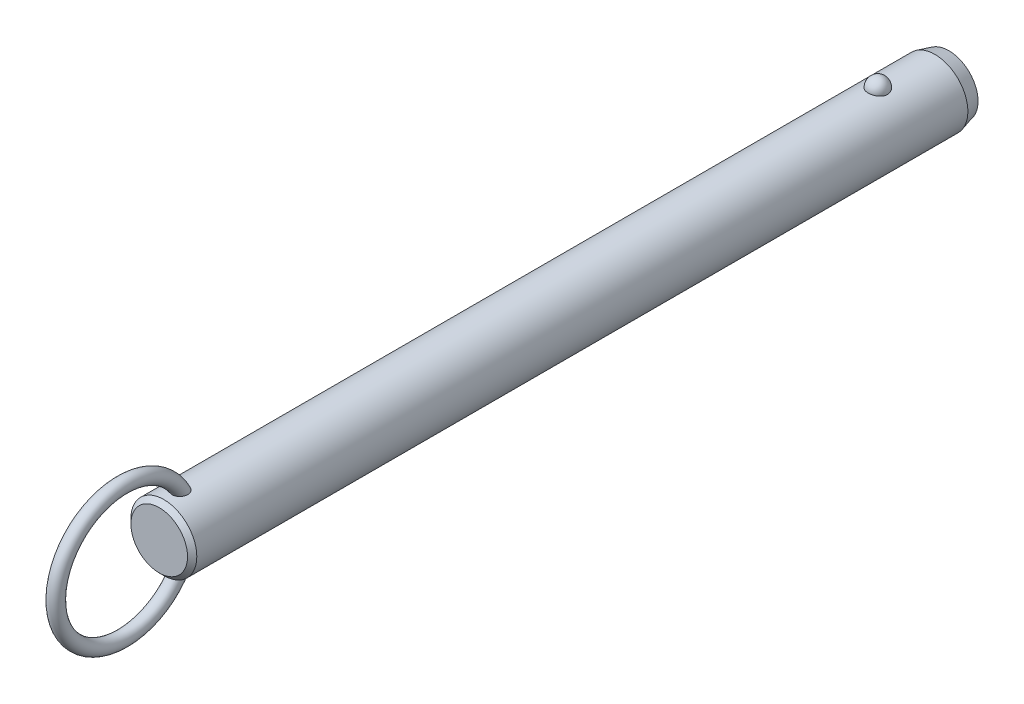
ISO-10303-21;
HEADER;
FILE_DESCRIPTION(('STEP AP214'),'2;1');
FILE_NAME('part.step','',(''),(''),'','','');
FILE_SCHEMA(('AUTOMOTIVE_DESIGN { 1 0 10303 214 1 1 1 1 }'));
ENDSEC;
DATA;
#1=APPLICATION_CONTEXT('core data for automotive mechanical design processes');
#2=APPLICATION_PROTOCOL_DEFINITION('international standard','automotive_design',2000,#1);
#3=PRODUCT_CONTEXT('',#1,'mechanical');
#4=PRODUCT('Part','Part','',(#3));
#5=PRODUCT_RELATED_PRODUCT_CATEGORY('part','',(#4));
#6=PRODUCT_DEFINITION_FORMATION('','',#4);
#7=PRODUCT_DEFINITION_CONTEXT('part definition',#1,'design');
#8=PRODUCT_DEFINITION('design','',#6,#7);
#9=PRODUCT_DEFINITION_SHAPE('','',#8);
#10=(LENGTH_UNIT() NAMED_UNIT(*) SI_UNIT(.MILLI.,.METRE.));
#11=(NAMED_UNIT(*) PLANE_ANGLE_UNIT() SI_UNIT($,.RADIAN.));
#12=(NAMED_UNIT(*) SI_UNIT($,.STERADIAN.) SOLID_ANGLE_UNIT());
#13=UNCERTAINTY_MEASURE_WITH_UNIT(LENGTH_MEASURE(1.E-05),#10,'distance_accuracy_value','');
#14=(GEOMETRIC_REPRESENTATION_CONTEXT(3) GLOBAL_UNCERTAINTY_ASSIGNED_CONTEXT((#13)) GLOBAL_UNIT_ASSIGNED_CONTEXT((#10,
#11,#12)) REPRESENTATION_CONTEXT('',''));
#15=CARTESIAN_POINT('',(0.,0.,0.));
#16=DIRECTION('',(0.,0.,1.));
#17=DIRECTION('',(1.,0.,0.));
#18=AXIS2_PLACEMENT_3D('',#15,#16,#17);
#19=CARTESIAN_POINT('',(0.,0.,144.8));
#20=DIRECTION('',(0.,0.,-1.));
#21=DIRECTION('',(-1.,0.,0.));
#22=AXIS2_PLACEMENT_3D('',#19,#20,#21);
#23=CYLINDRICAL_SURFACE('',#22,7.1);
#24=CARTESIAN_POINT('',(2.0769088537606,6.78943661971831,-2.10000000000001));
#25=CARTESIAN_POINT('',(2.07690739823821,6.78943796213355,-1.98268154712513));
#26=CARTESIAN_POINT('',(2.06738130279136,6.79237331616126,-1.86534506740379));
#27=CARTESIAN_POINT('',(2.0295040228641,6.8037853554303,-1.63400788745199));
#28=CARTESIAN_POINT('',(2.00114757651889,6.81226358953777,-1.52000812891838));
#29=CARTESIAN_POINT('',(1.92632025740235,6.83379798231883,-1.29863433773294));
#30=CARTESIAN_POINT('',(1.87985726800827,6.84685214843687,-1.19125744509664));
#31=CARTESIAN_POINT('',(1.76995205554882,6.87608091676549,-0.986046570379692));
#32=CARTESIAN_POINT('',(1.70650980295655,6.8922555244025,-0.888212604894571));
#33=CARTESIAN_POINT('',(1.56381192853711,6.92602930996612,-0.704242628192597));
#34=CARTESIAN_POINT('',(1.4844714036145,6.94363582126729,-0.618173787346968));
#35=CARTESIAN_POINT('',(1.31221746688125,6.97823658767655,-0.460740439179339));
#36=CARTESIAN_POINT('',(1.21930409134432,6.99523084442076,-0.389375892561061));
#37=CARTESIAN_POINT('',(1.02268781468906,7.02666176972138,-0.263547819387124));
#38=CARTESIAN_POINT('',(0.919020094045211,7.04110638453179,-0.209031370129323));
#39=CARTESIAN_POINT('',(0.703548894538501,7.06588726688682,-0.118163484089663));
#40=CARTESIAN_POINT('',(0.591746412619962,7.07622403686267,-0.0818098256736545));
#41=CARTESIAN_POINT('',(0.365557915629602,7.09147068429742,-0.0288711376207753));
#42=CARTESIAN_POINT('',(0.251267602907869,7.09648447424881,-0.011907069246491));
#43=CARTESIAN_POINT('',(0.0213499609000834,7.10089837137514,0.00304925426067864));
#44=CARTESIAN_POINT('',(-0.0942772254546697,7.10029907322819,0.00104351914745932));
#45=CARTESIAN_POINT('',(-0.3216515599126,7.09360829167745,-0.0216931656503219));
#46=CARTESIAN_POINT('',(-0.433431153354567,7.08760388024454,-0.0421272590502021));
#47=CARTESIAN_POINT('',(-0.651862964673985,7.07086131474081,-0.100729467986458));
#48=CARTESIAN_POINT('',(-0.758515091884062,7.06012307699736,-0.13889789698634));
#49=CARTESIAN_POINT('',(-0.964449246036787,7.03496097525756,-0.232213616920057));
#50=CARTESIAN_POINT('',(-1.06368095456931,7.02051445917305,-0.287465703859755));
#51=CARTESIAN_POINT('',(-1.25145353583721,6.98948740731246,-0.413383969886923));
#52=CARTESIAN_POINT('',(-1.33999321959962,6.97290663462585,-0.484051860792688));
#53=CARTESIAN_POINT('',(-1.50591604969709,6.93898770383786,-0.640594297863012));
#54=CARTESIAN_POINT('',(-1.58302488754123,6.92164094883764,-0.726757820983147));
#55=CARTESIAN_POINT('',(-1.72189320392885,6.8884103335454,-0.910927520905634));
#56=CARTESIAN_POINT('',(-1.78365144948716,6.87252659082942,-1.00893464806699));
#57=CARTESIAN_POINT('',(-1.89101272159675,6.84377189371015,-1.21549497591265));
#58=CARTESIAN_POINT('',(-1.93639553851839,6.83094274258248,-1.32416860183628));
#59=CARTESIAN_POINT('',(-2.00874275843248,6.81002070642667,-1.54791500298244));
#60=CARTESIAN_POINT('',(-2.03570774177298,6.80192767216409,-1.66298757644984));
#61=CARTESIAN_POINT('',(-2.07047276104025,6.7914266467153,-1.89571453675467));
#62=CARTESIAN_POINT('',(-2.07835878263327,6.78899315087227,-2.01335491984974));
#63=CARTESIAN_POINT('',(-2.07502083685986,6.79001409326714,-2.24833570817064));
#64=CARTESIAN_POINT('',(-2.06379746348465,6.7934683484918,-2.36567612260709));
#65=CARTESIAN_POINT('',(-2.02263913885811,6.80583442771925,-2.59603194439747));
#66=CARTESIAN_POINT('',(-1.99281127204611,6.81471501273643,-2.70906820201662));
#67=CARTESIAN_POINT('',(-1.91526639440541,6.83691232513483,-2.92836575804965));
#68=CARTESIAN_POINT('',(-1.8675486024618,6.85022924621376,-3.03462676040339));
#69=CARTESIAN_POINT('',(-1.75504492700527,6.87991336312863,-3.23806487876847));
#70=CARTESIAN_POINT('',(-1.69015924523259,6.89629822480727,-3.33518422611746));
#71=CARTESIAN_POINT('',(-1.54505404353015,6.93024852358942,-3.51697105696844));
#72=CARTESIAN_POINT('',(-1.46483385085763,6.94781401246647,-3.60163799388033));
#73=CARTESIAN_POINT('',(-1.29071406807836,6.98225977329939,-3.75654119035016));
#74=CARTESIAN_POINT('',(-1.19675650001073,6.99913673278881,-3.82671308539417));
#75=CARTESIAN_POINT('',(-0.997940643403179,7.03023618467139,-3.9501837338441));
#76=CARTESIAN_POINT('',(-0.893083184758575,7.04445887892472,-4.00348377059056));
#77=CARTESIAN_POINT('',(-0.676902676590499,7.06848365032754,-4.09107242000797));
#78=CARTESIAN_POINT('',(-0.565686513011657,7.0783430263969,-4.12560889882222));
#79=CARTESIAN_POINT('',(-0.338739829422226,7.09282534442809,-4.17575450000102));
#80=CARTESIAN_POINT('',(-0.2230099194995,7.09744899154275,-4.19136617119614));
#81=CARTESIAN_POINT('',(0.00707628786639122,7.10090930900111,-4.20307965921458));
#82=CARTESIAN_POINT('',(0.121410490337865,7.09986531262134,-4.19958377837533));
#83=CARTESIAN_POINT('',(0.34781544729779,7.092380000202,-4.17411564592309));
#84=CARTESIAN_POINT('',(0.459886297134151,7.08593891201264,-4.15214417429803));
#85=CARTESIAN_POINT('',(0.67808462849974,7.06838983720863,-4.09049562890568));
#86=CARTESIAN_POINT('',(0.784237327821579,7.05730369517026,-4.05090137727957));
#87=CARTESIAN_POINT('',(0.988305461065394,7.03163139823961,-3.95511447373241));
#88=CARTESIAN_POINT('',(1.08622031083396,7.01704499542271,-3.89892064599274));
#89=CARTESIAN_POINT('',(1.27284490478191,6.98562668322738,-3.77035541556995));
#90=CARTESIAN_POINT('',(1.36137372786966,6.96876135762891,-3.69772964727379));
#91=CARTESIAN_POINT('',(1.52509486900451,6.93477412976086,-3.53878279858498));
#92=CARTESIAN_POINT('',(1.60028496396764,6.91765218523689,-3.45245943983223));
#93=CARTESIAN_POINT('',(1.73681688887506,6.88465753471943,-3.26658774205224));
#94=CARTESIAN_POINT('',(1.79785966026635,6.86881574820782,-3.16681408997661));
#95=CARTESIAN_POINT('',(1.90265327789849,6.84053157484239,-2.95814408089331));
#96=CARTESIAN_POINT('',(1.94640861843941,6.82808830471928,-2.84925010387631));
#97=CARTESIAN_POINT('',(2.01274378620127,6.80881460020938,-2.63454318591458));
#98=CARTESIAN_POINT('',(2.03676193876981,6.80160856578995,-2.52920574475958));
#99=CARTESIAN_POINT('',(2.06884490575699,6.79191902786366,-2.3159172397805));
#100=CARTESIAN_POINT('',(2.07691019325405,6.78943538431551,-2.20796625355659));
#101=CARTESIAN_POINT('',(2.0769088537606,6.78943661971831,-2.10000000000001));
#102=B_SPLINE_CURVE_WITH_KNOTS('',3,(#24,#25,#26,#27,#28,#29,#30,#31,#32,#33,#34,#35,#36,#37,
#38,#39,#40,#41,#42,#43,#44,#45,#46,#47,#48,#49,#50,#51,#52,#53,#54,#55,#56,#57,#58,#59,#60,#61,
#62,#63,#64,#65,#66,#67,#68,#69,#70,#71,#72,#73,#74,#75,#76,#77,#78,#79,#80,#81,#82,#83,#84,#85,
#86,#87,#88,#89,#90,#91,#92,#93,#94,#95,#96,#97,#98,#99,#100,#101),.UNSPECIFIED.,.T.,.F.,(4,2,2,
2,2,2,2,2,2,2,2,2,2,2,2,2,2,2,2,2,2,2,2,2,2,2,2,2,2,2,2,2,2,2,2,2,2,2,4),(0.,0.351568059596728,
0.703234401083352,1.05474780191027,1.40626181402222,1.75970563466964,2.11314851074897,
2.46546960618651,2.81774759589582,3.16301449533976,3.50824481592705,3.84801136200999,
4.18778391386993,4.52968352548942,4.87162112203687,5.22076181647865,5.56993054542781,
5.92363364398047,6.27732559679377,6.62942052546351,6.98150450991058,7.33158042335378,
7.68167162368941,8.03384443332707,8.38603269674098,8.73975272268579,9.09344583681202,
9.44234545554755,9.79119807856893,10.1327344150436,10.4742563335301,10.8141898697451,
11.1541474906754,11.4997793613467,11.8454687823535,12.1979079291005,12.5502553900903,
12.8738073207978,13.1973496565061),.UNSPECIFIED.);
#103=CARTESIAN_POINT('',(2.0769088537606,6.78943661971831,-2.10000000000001));
#104=VERTEX_POINT('',#103);
#105=EDGE_CURVE('E41',#104,#104,#102,.T.);
#106=ORIENTED_EDGE('',*,*,#105,.T.);
#107=EDGE_LOOP('',(#106));
#108=FACE_BOUND('',#107,.T.);
#109=CARTESIAN_POINT('',(0.,0.,151.72));
#110=DIRECTION('',(0.,0.,1.));
#111=DIRECTION('',(1.,0.,0.));
#112=AXIS2_PLACEMENT_3D('',#109,#110,#111);
#113=CIRCLE('',#112,7.1);
#114=CARTESIAN_POINT('',(7.1,0.,151.72));
#115=VERTEX_POINT('',#114);
#116=EDGE_CURVE('E10',#115,#115,#113,.F.);
#117=ORIENTED_EDGE('',*,*,#116,.T.);
#118=EDGE_LOOP('',(#117));
#119=FACE_BOUND('',#118,.T.);
#120=CARTESIAN_POINT('',(-0.429539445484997,-7.08699541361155,146.542921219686));
#121=CARTESIAN_POINT('',(-0.508331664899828,-7.08221999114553,146.566876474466));
#122=CARTESIAN_POINT('',(-0.585039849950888,-7.07624016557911,146.597457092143));
#123=CARTESIAN_POINT('',(-0.73208265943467,-7.06254296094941,146.671024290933));
#124=CARTESIAN_POINT('',(-0.802417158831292,-7.05482554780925,146.714011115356));
#125=CARTESIAN_POINT('',(-0.934722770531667,-7.03851844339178,146.811113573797));
#126=CARTESIAN_POINT('',(-0.996700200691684,-7.02992941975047,146.865220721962));
#127=CARTESIAN_POINT('',(-1.11079942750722,-7.01280697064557,146.982967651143));
#128=CARTESIAN_POINT('',(-1.16292136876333,-7.00427354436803,147.046607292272));
#129=CARTESIAN_POINT('',(-1.25705660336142,-6.98799959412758,147.182687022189));
#130=CARTESIAN_POINT('',(-1.29888032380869,-6.98027525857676,147.255259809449));
#131=CARTESIAN_POINT('',(-1.37069920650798,-6.96652886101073,147.406168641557));
#132=CARTESIAN_POINT('',(-1.40069157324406,-6.96050720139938,147.484506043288));
#133=CARTESIAN_POINT('',(-1.45043507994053,-6.95031881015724,147.650190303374));
#134=CARTESIAN_POINT('',(-1.46937115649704,-6.94630231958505,147.737789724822));
#135=CARTESIAN_POINT('',(-1.49424917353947,-6.94099239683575,147.914871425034));
#136=CARTESIAN_POINT('',(-1.50018601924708,-6.93970003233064,148.004354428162));
#137=CARTESIAN_POINT('',(-1.49978214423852,-6.93978815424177,148.194060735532));
#138=CARTESIAN_POINT('',(-1.49187639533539,-6.94150934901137,148.294279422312));
#139=CARTESIAN_POINT('',(-1.46177925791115,-6.94790814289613,148.492479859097));
#140=CARTESIAN_POINT('',(-1.43957541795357,-6.95258831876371,148.590459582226));
#141=CARTESIAN_POINT('',(-1.37783293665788,-6.96510647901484,148.79536292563));
#142=CARTESIAN_POINT('',(-1.33634073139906,-6.97328848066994,148.901680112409));
#143=CARTESIAN_POINT('',(-1.23686994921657,-6.99161706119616,149.106177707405));
#144=CARTESIAN_POINT('',(-1.17889192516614,-7.00176357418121,149.204358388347));
#145=CARTESIAN_POINT('',(-1.05875124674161,-7.02082898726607,149.372374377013));
#146=CARTESIAN_POINT('',(-0.999247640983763,-7.02963746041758,149.444123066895));
#147=CARTESIAN_POINT('',(-0.869494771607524,-7.04686074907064,149.577195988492));
#148=CARTESIAN_POINT('',(-0.799263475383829,-7.05527619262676,149.638537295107));
#149=CARTESIAN_POINT('',(-0.665408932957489,-7.06899457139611,149.735131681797));
#150=CARTESIAN_POINT('',(-0.603817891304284,-7.07457275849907,149.773151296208));
#151=CARTESIAN_POINT('',(-0.475172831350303,-7.08437420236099,149.838758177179));
#152=CARTESIAN_POINT('',(-0.408123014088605,-7.08859848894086,149.866353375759));
#153=CARTESIAN_POINT('',(-0.26943193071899,-7.09522749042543,149.909256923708));
#154=CARTESIAN_POINT('',(-0.19775731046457,-7.09761688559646,149.924461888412));
#155=CARTESIAN_POINT('',(-0.0527849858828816,-7.10017268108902,149.940716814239));
#156=CARTESIAN_POINT('',(0.0205115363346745,-7.10034065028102,149.941776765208));
#157=CARTESIAN_POINT('',(0.156426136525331,-7.09855986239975,149.930461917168));
#158=CARTESIAN_POINT('',(0.219199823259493,-7.09688191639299,149.919806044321));
#159=CARTESIAN_POINT('',(0.342134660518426,-7.09201880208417,149.888537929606));
#160=CARTESIAN_POINT('',(0.40229529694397,-7.08883333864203,149.867923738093));
#161=CARTESIAN_POINT('',(0.520687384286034,-7.08113868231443,149.817212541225));
#162=CARTESIAN_POINT('',(0.578791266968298,-7.07658958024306,149.786827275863));
#163=CARTESIAN_POINT('',(0.69017323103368,-7.06659708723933,149.718367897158));
#164=CARTESIAN_POINT('',(0.743447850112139,-7.061153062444,149.680288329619));
#165=CARTESIAN_POINT('',(0.870947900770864,-7.04680292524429,149.576592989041));
#166=CARTESIAN_POINT('',(0.941828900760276,-7.03755800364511,149.506897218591));
#167=CARTESIAN_POINT('',(1.07136606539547,-7.01900793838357,149.356945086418));
#168=CARTESIAN_POINT('',(1.13000013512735,-7.00970271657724,149.276670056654));
#169=CARTESIAN_POINT('',(1.23579584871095,-6.99183327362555,149.106899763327));
#170=CARTESIAN_POINT('',(1.28274271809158,-6.98328455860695,149.017269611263));
#171=CARTESIAN_POINT('',(1.3635144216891,-6.96796352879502,148.832176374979));
#172=CARTESIAN_POINT('',(1.39733971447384,-6.96119115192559,148.736713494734));
#173=CARTESIAN_POINT('',(1.45579181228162,-6.94922464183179,148.52530928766));
#174=CARTESIAN_POINT('',(1.47790145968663,-6.94449000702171,148.408631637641));
#175=CARTESIAN_POINT('',(1.50168752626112,-6.93938731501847,148.173015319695));
#176=CARTESIAN_POINT('',(1.50336085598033,-6.93901991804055,148.05407631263));
#177=CARTESIAN_POINT('',(1.48486516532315,-6.9430010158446,147.82360799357));
#178=CARTESIAN_POINT('',(1.46573441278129,-6.9471253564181,147.711995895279));
#179=CARTESIAN_POINT('',(1.40606892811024,-6.95944667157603,147.494886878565));
#180=CARTESIAN_POINT('',(1.36556446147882,-6.96763788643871,147.3893815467));
#181=CARTESIAN_POINT('',(1.2708270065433,-6.98548038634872,147.204287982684));
#182=CARTESIAN_POINT('',(1.21949810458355,-6.99473841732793,147.123171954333));
#183=CARTESIAN_POINT('',(1.10242050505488,-7.01414069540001,146.972227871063));
#184=CARTESIAN_POINT('',(1.03668119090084,-7.02428436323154,146.90239252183));
#185=CARTESIAN_POINT('',(0.900559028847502,-7.04295285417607,146.783573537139));
#186=CARTESIAN_POINT('',(0.831428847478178,-7.05153466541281,146.733157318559));
#187=CARTESIAN_POINT('',(0.685291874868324,-7.06723150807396,146.645142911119));
#188=CARTESIAN_POINT('',(0.608287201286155,-7.07434693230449,146.607541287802));
#189=CARTESIAN_POINT('',(0.451878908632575,-7.08602232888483,146.547491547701));
#190=CARTESIAN_POINT('',(0.372686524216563,-7.09067127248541,146.524508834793));
#191=CARTESIAN_POINT('',(0.211477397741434,-7.09730788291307,146.492035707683));
#192=CARTESIAN_POINT('',(0.129460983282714,-7.09929585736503,146.48254373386));
#193=CARTESIAN_POINT('',(-0.0332905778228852,-7.10037858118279,146.477351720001));
#194=CARTESIAN_POINT('',(-0.114016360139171,-7.09953334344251,146.481365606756));
#195=CARTESIAN_POINT('',(-0.273670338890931,-7.09517338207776,146.502454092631));
#196=CARTESIAN_POINT('',(-0.352598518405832,-7.09165863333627,146.519528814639));
#197=CARTESIAN_POINT('',(-0.429539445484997,-7.08699541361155,146.542921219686));
#198=B_SPLINE_CURVE_WITH_KNOTS('',3,(#120,#121,#122,#123,#124,#125,#126,#127,#128,#129,#130,
#131,#132,#133,#134,#135,#136,#137,#138,#139,#140,#141,#142,#143,#144,#145,#146,#147,#148,#149,
#150,#151,#152,#153,#154,#155,#156,#157,#158,#159,#160,#161,#162,#163,#164,#165,#166,#167,#168,
#169,#170,#171,#172,#173,#174,#175,#176,#177,#178,#179,#180,#181,#182,#183,#184,#185,#186,#187,
#188,#189,#190,#191,#192,#193,#194,#195,#196,#197),.UNSPECIFIED.,.T.,.F.,(4,2,2,2,2,2,2,2,2,2,2,
2,2,2,2,2,2,2,2,2,2,2,2,2,2,2,2,2,2,2,2,2,2,2,2,2,2,2,4),(0.,0.247183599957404,
0.494372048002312,0.741372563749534,0.988369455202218,1.23962059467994,1.490931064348,
1.75897818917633,2.02713035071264,2.3275826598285,2.62829697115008,2.97008736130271,
3.31186629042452,3.59175319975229,3.87117637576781,4.08813841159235,4.30493502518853,
4.5235225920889,4.74195577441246,4.93215328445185,5.12238804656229,5.31884850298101,
5.51544871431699,5.81332317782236,6.11173048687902,6.41527266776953,6.71880423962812,
7.07358156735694,7.42841252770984,7.76631485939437,8.10373999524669,8.39142246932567,
8.67891817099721,8.93560332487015,9.19221962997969,9.43881106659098,9.68537399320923,
9.92674752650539,10.1681233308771),.UNSPECIFIED.);
#199=CARTESIAN_POINT('',(-0.429539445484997,-7.08699541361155,146.542921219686));
#200=VERTEX_POINT('',#199);
#201=EDGE_CURVE('E60',#200,#200,#198,.T.);
#202=ORIENTED_EDGE('',*,*,#201,.T.);
#203=EDGE_LOOP('',(#202));
#204=FACE_BOUND('',#203,.T.);
#205=CARTESIAN_POINT('',(-0.429539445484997,7.08699541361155,146.542921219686));
#206=CARTESIAN_POINT('',(-0.351665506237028,7.09171429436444,146.519246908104));
#207=CARTESIAN_POINT('',(-0.271733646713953,7.09525896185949,146.502036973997));
#208=CARTESIAN_POINT('',(-0.110026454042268,7.09960839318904,146.481005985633));
#209=CARTESIAN_POINT('',(-0.0282502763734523,7.10041187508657,146.477191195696));
#210=CARTESIAN_POINT('',(0.134782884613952,7.09918849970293,146.483059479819));
#211=CARTESIAN_POINT('',(0.216039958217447,7.09716214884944,146.49274013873));
#212=CARTESIAN_POINT('',(0.375730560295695,7.09050177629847,146.525347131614));
#213=CARTESIAN_POINT('',(0.454164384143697,7.08586802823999,146.548272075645));
#214=CARTESIAN_POINT('',(0.606025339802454,7.07449911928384,146.606771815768));
#215=CARTESIAN_POINT('',(0.67945100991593,7.06776334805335,146.642350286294));
#216=CARTESIAN_POINT('',(0.819234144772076,7.05292866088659,146.725175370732));
#217=CARTESIAN_POINT('',(0.88559181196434,7.04482978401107,146.772421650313));
#218=CARTESIAN_POINT('',(1.00993211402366,7.02808709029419,146.877590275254));
#219=CARTESIAN_POINT('',(1.06785399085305,7.01943990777,146.935583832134));
#220=CARTESIAN_POINT('',(1.17342527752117,7.00256662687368,147.060301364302));
#221=CARTESIAN_POINT('',(1.22107408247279,6.99434055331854,147.127025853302));
#222=CARTESIAN_POINT('',(1.30652927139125,6.97889183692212,147.269362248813));
#223=CARTESIAN_POINT('',(1.34399711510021,6.97170674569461,147.345180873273));
#224=CARTESIAN_POINT('',(1.40682616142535,6.95930080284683,147.501810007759));
#225=CARTESIAN_POINT('',(1.43218374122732,6.95408053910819,147.58262200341));
#226=CARTESIAN_POINT('',(1.47246409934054,6.94566853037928,147.753531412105));
#227=CARTESIAN_POINT('',(1.48642590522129,6.9426653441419,147.84386307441));
#228=CARTESIAN_POINT('',(1.5011410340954,6.93949744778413,148.025619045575));
#229=CARTESIAN_POINT('',(1.50188917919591,6.93933385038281,148.117043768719));
#230=CARTESIAN_POINT('',(1.49030464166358,6.94183245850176,148.31084381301));
#231=CARTESIAN_POINT('',(1.47627413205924,6.94486147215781,148.413112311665));
#232=CARTESIAN_POINT('',(1.43356351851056,6.95380194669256,148.614471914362));
#233=CARTESIAN_POINT('',(1.4048676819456,6.95971650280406,148.713559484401));
#234=CARTESIAN_POINT('',(1.32908750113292,6.97461208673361,148.918908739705));
#235=CARTESIAN_POINT('',(1.28011435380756,6.98388945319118,149.024456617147));
#236=CARTESIAN_POINT('',(1.16520357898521,7.00397743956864,149.225760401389));
#237=CARTESIAN_POINT('',(1.09927694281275,7.01478706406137,149.321522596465));
#238=CARTESIAN_POINT('',(0.969361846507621,7.03373936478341,149.476756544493));
#239=CARTESIAN_POINT('',(0.909042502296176,7.04187023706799,149.539303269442));
#240=CARTESIAN_POINT('',(0.779178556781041,7.05741732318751,149.654053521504));
#241=CARTESIAN_POINT('',(0.709649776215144,7.06483472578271,149.706274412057));
#242=CARTESIAN_POINT('',(0.576854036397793,7.0767751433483,149.788113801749));
#243=CARTESIAN_POINT('',(0.515118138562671,7.08158033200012,149.820164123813));
#244=CARTESIAN_POINT('',(0.387127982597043,7.08972701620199,149.873765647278));
#245=CARTESIAN_POINT('',(0.320877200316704,7.09306962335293,149.895324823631));
#246=CARTESIAN_POINT('',(0.185041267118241,7.09791507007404,149.926400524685));
#247=CARTESIAN_POINT('',(0.115437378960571,7.09940591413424,149.935838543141));
#248=CARTESIAN_POINT('',(-0.0243157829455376,7.10030171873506,149.941522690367));
#249=CARTESIAN_POINT('',(-0.0944648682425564,7.0997073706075,149.937773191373));
#250=CARTESIAN_POINT('',(-0.225713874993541,7.09668414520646,149.918508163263));
#251=CARTESIAN_POINT('',(-0.287006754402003,7.09444865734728,149.904232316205));
#252=CARTESIAN_POINT('',(-0.406555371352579,7.08860360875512,149.866368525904));
#253=CARTESIAN_POINT('',(-0.464809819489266,7.08499346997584,149.842776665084));
#254=CARTESIAN_POINT('',(-0.594955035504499,7.07541654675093,149.778923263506));
#255=CARTESIAN_POINT('',(-0.665389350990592,7.06906574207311,149.735753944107));
#256=CARTESIAN_POINT('',(-0.798242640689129,7.05530261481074,149.638587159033));
#257=CARTESIAN_POINT('',(-0.860645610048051,7.0478882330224,149.584568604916));
#258=CARTESIAN_POINT('',(-0.994249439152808,7.03045217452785,149.450996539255));
#259=CARTESIAN_POINT('',(-1.06260129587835,7.02030745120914,149.368614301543));
#260=CARTESIAN_POINT('',(-1.18502045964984,7.00068382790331,149.193843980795));
#261=CARTESIAN_POINT('',(-1.23907684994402,6.99120544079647,149.101448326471));
#262=CARTESIAN_POINT('',(-1.33335589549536,6.97384343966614,148.908008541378));
#263=CARTESIAN_POINT('',(-1.37336138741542,6.96598557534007,148.806856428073));
#264=CARTESIAN_POINT('',(-1.43770677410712,6.95299053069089,148.599504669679));
#265=CARTESIAN_POINT('',(-1.46204473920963,6.94785368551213,148.49330440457));
#266=CARTESIAN_POINT('',(-1.49537533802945,6.94076296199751,148.268231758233));
#267=CARTESIAN_POINT('',(-1.50273564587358,6.93914842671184,148.14909751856));
#268=CARTESIAN_POINT('',(-1.4954555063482,6.94072368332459,147.911470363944));
#269=CARTESIAN_POINT('',(-1.48082914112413,6.94391040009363,147.792977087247));
#270=CARTESIAN_POINT('',(-1.43076401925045,6.95438579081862,147.573432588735));
#271=CARTESIAN_POINT('',(-1.39762227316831,6.96121852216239,147.471841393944));
#272=CARTESIAN_POINT('',(-1.31211274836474,6.97783941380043,147.277351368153));
#273=CARTESIAN_POINT('',(-1.25976607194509,6.98762432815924,147.18444313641));
#274=CARTESIAN_POINT('',(-1.14583073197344,7.00713153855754,147.024160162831));
#275=CARTESIAN_POINT('',(-1.08665947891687,7.01665982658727,146.955035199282));
#276=CARTESIAN_POINT('',(-0.95660664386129,7.03556646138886,146.828878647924));
#277=CARTESIAN_POINT('',(-0.88573712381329,7.04494495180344,146.771834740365));
#278=CARTESIAN_POINT('',(-0.751558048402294,7.06035735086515,146.683100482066));
#279=CARTESIAN_POINT('',(-0.690120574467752,7.0666695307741,146.648593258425));
#280=CARTESIAN_POINT('',(-0.562815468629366,7.07794609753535,146.588750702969));
#281=CARTESIAN_POINT('',(-0.496948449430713,7.08291067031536,146.563414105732));
#282=CARTESIAN_POINT('',(-0.429539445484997,7.08699541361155,146.542921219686));
#283=B_SPLINE_CURVE_WITH_KNOTS('',3,(#205,#206,#207,#208,#209,#210,#211,#212,#213,#214,#215,
#216,#217,#218,#219,#220,#221,#222,#223,#224,#225,#226,#227,#228,#229,#230,#231,#232,#233,#234,
#235,#236,#237,#238,#239,#240,#241,#242,#243,#244,#245,#246,#247,#248,#249,#250,#251,#252,#253,
#254,#255,#256,#257,#258,#259,#260,#261,#262,#263,#264,#265,#266,#267,#268,#269,#270,#271,#272,
#273,#274,#275,#276,#277,#278,#279,#280,#281,#282),.UNSPECIFIED.,.T.,.F.,(4,2,2,2,2,2,2,2,2,2,2,
2,2,2,2,2,2,2,2,2,2,2,2,2,2,2,2,2,2,2,2,2,2,2,2,2,2,2,4),(0.,0.244335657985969,
0.488785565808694,0.733191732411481,0.977572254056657,1.2220237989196,1.46646834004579,
1.71259457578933,1.9587352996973,2.21226768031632,2.46587585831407,2.73913816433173,
3.01250754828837,3.32109936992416,3.63002293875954,3.9786351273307,4.32702187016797,
4.58793945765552,4.84841449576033,5.05676704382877,5.26496096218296,5.47449661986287,
5.68396281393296,5.87205447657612,6.06022532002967,6.30743751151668,6.55513496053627,
6.87602468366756,7.19715875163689,7.5230577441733,7.84899686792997,8.2051615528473,
8.56109821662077,8.88040084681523,9.19935367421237,9.47236282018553,9.74509220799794,
9.95662250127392,10.1681235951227),.UNSPECIFIED.);
#284=CARTESIAN_POINT('',(-0.429539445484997,7.08699541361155,146.542921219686));
#285=VERTEX_POINT('',#284);
#286=EDGE_CURVE('E68',#285,#285,#283,.T.);
#287=ORIENTED_EDGE('',*,*,#286,.T.);
#288=EDGE_LOOP('',(#287));
#289=FACE_BOUND('',#288,.T.);
#290=CARTESIAN_POINT('',(0.,0.,-14.4000000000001));
#291=DIRECTION('',(0.,0.,-1.));
#292=DIRECTION('',(-1.,0.,0.));
#293=AXIS2_PLACEMENT_3D('',#290,#291,#292);
#294=CIRCLE('',#293,7.1);
#295=CARTESIAN_POINT('',(-7.1,0.,-14.4000000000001));
#296=VERTEX_POINT('',#295);
#297=EDGE_CURVE('E57',#296,#296,#294,.F.);
#298=ORIENTED_EDGE('',*,*,#297,.T.);
#299=EDGE_LOOP('',(#298));
#300=FACE_BOUND('',#299,.T.);
#301=ADVANCED_FACE('F37',(#108,#119,#204,#289,#300),#23,.T.);
#302=CARTESIAN_POINT('',(0.,0.,-17.4));
#303=DIRECTION('',(0.,0.,-1.));
#304=DIRECTION('',(-1.,0.,0.));
#305=AXIS2_PLACEMENT_3D('',#302,#303,#304);
#306=PLANE('',#305);
#307=CARTESIAN_POINT('',(0.,0.,-17.4));
#308=DIRECTION('',(0.,0.,-1.));
#309=DIRECTION('',(-1.,0.,0.));
#310=AXIS2_PLACEMENT_3D('',#307,#308,#309);
#311=CIRCLE('',#310,6.29615242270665);
#312=CARTESIAN_POINT('',(-6.29615242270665,0.,-17.4));
#313=VERTEX_POINT('',#312);
#314=EDGE_CURVE('E67',#313,#313,#311,.T.);
#315=ORIENTED_EDGE('',*,*,#314,.T.);
#316=EDGE_LOOP('',(#315));
#317=FACE_BOUND('',#316,.T.);
#318=ADVANCED_FACE('F86',(#317),#306,.T.);
#319=CARTESIAN_POINT('',(0.,0.,-17.4));
#320=DIRECTION('',(0.,0.,1.));
#321=DIRECTION('',(1.,0.,0.));
#322=AXIS2_PLACEMENT_3D('',#319,#320,#321);
#323=CONICAL_SURFACE('',#322,6.29615242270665,0.261799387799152);
#324=ORIENTED_EDGE('',*,*,#297,.F.);
#325=EDGE_LOOP('',(#324));
#326=FACE_BOUND('',#325,.T.);
#327=ORIENTED_EDGE('',*,*,#314,.F.);
#328=EDGE_LOOP('',(#327));
#329=FACE_BOUND('',#328,.T.);
#330=ADVANCED_FACE('F84',(#326,#329),#323,.T.);
#331=CARTESIAN_POINT('',(0.,0.,152.72));
#332=DIRECTION('',(0.,0.,1.));
#333=DIRECTION('',(1.,0.,0.));
#334=AXIS2_PLACEMENT_3D('',#331,#332,#333);
#335=PLANE('',#334);
#336=CARTESIAN_POINT('',(0.,0.,152.72));
#337=DIRECTION('',(0.,0.,1.));
#338=DIRECTION('',(1.,0.,0.));
#339=AXIS2_PLACEMENT_3D('',#336,#337,#338);
#340=CIRCLE('',#339,6.10000000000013);
#341=CARTESIAN_POINT('',(6.10000000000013,0.,152.72));
#342=VERTEX_POINT('',#341);
#343=EDGE_CURVE('E50',#342,#342,#340,.T.);
#344=ORIENTED_EDGE('',*,*,#343,.T.);
#345=EDGE_LOOP('',(#344));
#346=FACE_BOUND('',#345,.T.);
#347=ADVANCED_FACE('F78',(#346),#335,.T.);
#348=CARTESIAN_POINT('',(0.,0.,160.65));
#349=DIRECTION('',(1.,0.,0.));
#350=DIRECTION('',(0.,0.,-1.));
#351=AXIS2_PLACEMENT_3D('',#348,#349,#350);
#352=TOROIDAL_SURFACE('',#351,14.35,1.5);
#353=ORIENTED_EDGE('',*,*,#286,.F.);
#354=EDGE_LOOP('',(#353));
#355=FACE_BOUND('',#354,.T.);
#356=ORIENTED_EDGE('',*,*,#201,.F.);
#357=EDGE_LOOP('',(#356));
#358=FACE_BOUND('',#357,.T.);
#359=ADVANCED_FACE('F74',(#355,#358),#352,.T.);
#360=CARTESIAN_POINT('',(0.,0.,152.72));
#361=DIRECTION('',(0.,0.,-1.));
#362=DIRECTION('',(-1.,0.,0.));
#363=AXIS2_PLACEMENT_3D('',#360,#361,#362);
#364=CONICAL_SURFACE('',#363,6.10000000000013,0.785398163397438);
#365=ORIENTED_EDGE('',*,*,#116,.F.);
#366=EDGE_LOOP('',(#365));
#367=FACE_BOUND('',#366,.T.);
#368=ORIENTED_EDGE('',*,*,#343,.F.);
#369=EDGE_LOOP('',(#368));
#370=FACE_BOUND('',#369,.T.);
#371=ADVANCED_FACE('F39',(#367,#370),#364,.T.);
#372=CARTESIAN_POINT('',(0.,7.1,-2.1));
#373=DIRECTION('',(0.,1.,0.));
#374=DIRECTION('',(0.,0.,1.));
#375=AXIS2_PLACEMENT_3D('',#372,#373,#374);
#376=SPHERICAL_SURFACE('',#375,2.10000000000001);
#377=ORIENTED_EDGE('',*,*,#105,.F.);
#378=EDGE_LOOP('',(#377));
#379=FACE_BOUND('',#378,.T.);
#380=ADVANCED_FACE('F80',(#379),#376,.T.);
#381=CLOSED_SHELL('',(#301,#318,#330,#347,#359,#371,#380));
#382=MANIFOLD_SOLID_BREP('B2',#381);
#383=ADVANCED_BREP_SHAPE_REPRESENTATION('',(#18,#382),#14);
#384=SHAPE_DEFINITION_REPRESENTATION(#9,#383);
ENDSEC;
END-ISO-10303-21;
